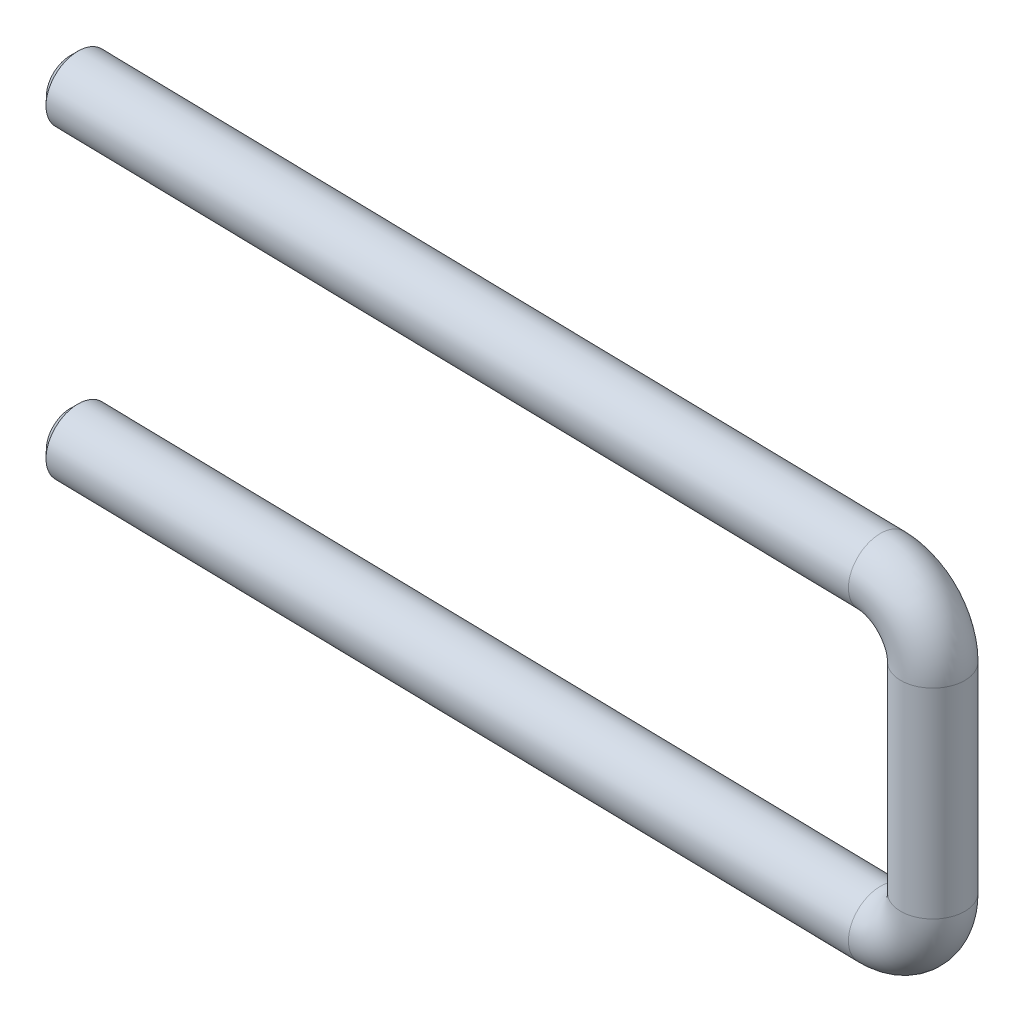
ISO-10303-21;
HEADER;
FILE_DESCRIPTION(('STEP AP214'),'2;1');
FILE_NAME('part.step','',(''),(''),'','','');
FILE_SCHEMA(('AUTOMOTIVE_DESIGN { 1 0 10303 214 1 1 1 1 }'));
ENDSEC;
DATA;
#1=APPLICATION_CONTEXT('core data for automotive mechanical design processes');
#2=APPLICATION_PROTOCOL_DEFINITION('international standard','automotive_design',2000,#1);
#3=PRODUCT_CONTEXT('',#1,'mechanical');
#4=PRODUCT('Part','Part','',(#3));
#5=PRODUCT_RELATED_PRODUCT_CATEGORY('part','',(#4));
#6=PRODUCT_DEFINITION_FORMATION('','',#4);
#7=PRODUCT_DEFINITION_CONTEXT('part definition',#1,'design');
#8=PRODUCT_DEFINITION('design','',#6,#7);
#9=PRODUCT_DEFINITION_SHAPE('','',#8);
#10=(LENGTH_UNIT() NAMED_UNIT(*) SI_UNIT(.MILLI.,.METRE.));
#11=(NAMED_UNIT(*) PLANE_ANGLE_UNIT() SI_UNIT($,.RADIAN.));
#12=(NAMED_UNIT(*) SI_UNIT($,.STERADIAN.) SOLID_ANGLE_UNIT());
#13=UNCERTAINTY_MEASURE_WITH_UNIT(LENGTH_MEASURE(1.E-05),#10,'distance_accuracy_value','');
#14=(GEOMETRIC_REPRESENTATION_CONTEXT(3) GLOBAL_UNCERTAINTY_ASSIGNED_CONTEXT((#13)) GLOBAL_UNIT_ASSIGNED_CONTEXT((#10,
#11,#12)) REPRESENTATION_CONTEXT('',''));
#15=CARTESIAN_POINT('',(0.,0.,0.));
#16=DIRECTION('',(0.,0.,1.));
#17=DIRECTION('',(1.,0.,0.));
#18=AXIS2_PLACEMENT_3D('',#15,#16,#17);
#19=CARTESIAN_POINT('',(-17.5405855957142,39.4239179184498,-0.785698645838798));
#20=DIRECTION('',(-0.999797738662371,0.,-0.0201117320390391));
#21=DIRECTION('',(0.,-1.,0.));
#22=AXIS2_PLACEMENT_3D('',#19,#20,#21);
#23=PLANE('',#22);
#24=CARTESIAN_POINT('',(-17.540585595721,39.4239179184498,-0.785698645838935));
#25=DIRECTION('',(0.999797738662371,0.,0.0201117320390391));
#26=DIRECTION('',(0.,1.,0.));
#27=AXIS2_PLACEMENT_3D('',#24,#25,#26);
#28=CIRCLE('',#27,1.49999999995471);
#29=CARTESIAN_POINT('',(-17.540585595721,40.9239179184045,-0.78569864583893));
#30=VERTEX_POINT('',#29);
#31=EDGE_CURVE('E15',#30,#30,#28,.T.);
#32=ORIENTED_EDGE('',*,*,#31,.F.);
#33=EDGE_LOOP('',(#32));
#34=FACE_BOUND('',#33,.T.);
#35=ADVANCED_FACE('F12',(#34),#23,.T.);
#36=CARTESIAN_POINT('',(-17.0406867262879,39.4239179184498,-0.775642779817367));
#37=DIRECTION('',(0.999797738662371,0.,0.0201117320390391));
#38=DIRECTION('',(0.,1.,0.));
#39=AXIS2_PLACEMENT_3D('',#36,#37,#38);
#40=CONICAL_SURFACE('',#39,2.00000000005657,0.785398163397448);
#41=CARTESIAN_POINT('',(-17.040686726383,39.4239179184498,-0.775642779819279));
#42=DIRECTION('',(-0.999797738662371,0.,-0.0201117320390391));
#43=DIRECTION('',(0.,-1.,0.));
#44=AXIS2_PLACEMENT_3D('',#41,#42,#43);
#45=CIRCLE('',#44,2.);
#46=CARTESIAN_POINT('',(-17.040686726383,37.4239179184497,-0.775642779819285));
#47=VERTEX_POINT('',#46);
#48=EDGE_CURVE('E59',#47,#47,#45,.F.);
#49=ORIENTED_EDGE('',*,*,#48,.F.);
#50=EDGE_LOOP('',(#49));
#51=FACE_BOUND('',#50,.T.);
#52=ORIENTED_EDGE('',*,*,#31,.T.);
#53=EDGE_LOOP('',(#52));
#54=FACE_BOUND('',#53,.T.);
#55=ADVANCED_FACE('F111',(#51,#54),#40,.T.);
#56=CARTESIAN_POINT('',(34.1489574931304,39.4239179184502,0.254077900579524));
#57=DIRECTION('',(-0.999797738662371,0.,-0.0201117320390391));
#58=DIRECTION('',(0.,-1.,0.));
#59=AXIS2_PLACEMENT_3D('',#56,#57,#58);
#60=CYLINDRICAL_SURFACE('',#59,2.);
#61=ORIENTED_EDGE('',*,*,#48,.T.);
#62=EDGE_LOOP('',(#61));
#63=FACE_BOUND('',#62,.T.);
#64=CARTESIAN_POINT('',(34.1489574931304,39.4239179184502,0.254077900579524));
#65=DIRECTION('',(-0.999797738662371,0.,-0.0201117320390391));
#66=DIRECTION('',(0.,1.,0.));
#67=AXIS2_PLACEMENT_3D('',#64,#65,#66);
#68=CIRCLE('',#67,2.);
#69=CARTESIAN_POINT('',(34.1489574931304,41.4239179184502,0.25407790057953));
#70=VERTEX_POINT('',#69);
#71=EDGE_CURVE('E56',#70,#70,#68,.F.);
#72=ORIENTED_EDGE('',*,*,#71,.F.);
#73=EDGE_LOOP('',(#72));
#74=FACE_BOUND('',#73,.T.);
#75=ADVANCED_FACE('F51',(#63,#74),#60,.T.);
#76=CARTESIAN_POINT('',(34.1489574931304,36.1239179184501,0.254077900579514));
#77=DIRECTION('',(-0.0201117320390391,0.,0.999797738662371));
#78=DIRECTION('',(0.999797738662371,0.,0.0201117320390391));
#79=AXIS2_PLACEMENT_3D('',#76,#77,#78);
#80=TOROIDAL_SURFACE('',#79,3.29999999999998,2.);
#81=ORIENTED_EDGE('',*,*,#71,.T.);
#82=EDGE_LOOP('',(#81));
#83=FACE_BOUND('',#82,.T.);
#84=CARTESIAN_POINT('',(37.4482900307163,36.1239179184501,0.320446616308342));
#85=DIRECTION('',(0.,1.,0.));
#86=DIRECTION('',(-0.999797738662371,0.,-0.0201117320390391));
#87=AXIS2_PLACEMENT_3D('',#84,#85,#86);
#88=CIRCLE('',#87,2.);
#89=CARTESIAN_POINT('',(35.4486945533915,36.1239179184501,0.280223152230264));
#90=VERTEX_POINT('',#89);
#91=EDGE_CURVE('E55',#90,#90,#88,.F.);
#92=ORIENTED_EDGE('',*,*,#91,.F.);
#93=EDGE_LOOP('',(#92));
#94=FACE_BOUND('',#93,.T.);
#95=ADVANCED_FACE('F46',(#83,#94),#80,.T.);
#96=CARTESIAN_POINT('',(37.4482900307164,23.6239179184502,0.320446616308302));
#97=DIRECTION('',(0.,1.,0.));
#98=DIRECTION('',(-0.999797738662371,0.,-0.0201117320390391));
#99=AXIS2_PLACEMENT_3D('',#96,#97,#98);
#100=CYLINDRICAL_SURFACE('',#99,2.);
#101=ORIENTED_EDGE('',*,*,#91,.T.);
#102=EDGE_LOOP('',(#101));
#103=FACE_BOUND('',#102,.T.);
#104=CARTESIAN_POINT('',(37.4482900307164,23.6239179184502,0.320446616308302));
#105=DIRECTION('',(0.,1.,0.));
#106=DIRECTION('',(0.999797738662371,0.,0.0201117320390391));
#107=AXIS2_PLACEMENT_3D('',#104,#105,#106);
#108=CIRCLE('',#107,2.);
#109=CARTESIAN_POINT('',(39.4478855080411,23.6239179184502,0.360670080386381));
#110=VERTEX_POINT('',#109);
#111=EDGE_CURVE('E29',#110,#110,#108,.F.);
#112=ORIENTED_EDGE('',*,*,#111,.F.);
#113=EDGE_LOOP('',(#112));
#114=FACE_BOUND('',#113,.T.);
#115=ADVANCED_FACE('F42',(#103,#114),#100,.T.);
#116=CARTESIAN_POINT('',(-17.5405855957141,20.3239179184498,-0.785698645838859));
#117=DIRECTION('',(0.999797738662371,0.,0.0201117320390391));
#118=DIRECTION('',(0.,1.,0.));
#119=AXIS2_PLACEMENT_3D('',#116,#117,#118);
#120=PLANE('',#119);
#121=CARTESIAN_POINT('',(-17.5405855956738,20.3239179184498,-0.78569864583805));
#122=DIRECTION('',(0.999797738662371,0.,0.0201117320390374));
#123=DIRECTION('',(0.0201117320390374,0.,-0.999797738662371));
#124=AXIS2_PLACEMENT_3D('',#121,#122,#123);
#125=CIRCLE('',#124,1.49999999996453);
#126=CARTESIAN_POINT('',(-17.510417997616,20.3239179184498,-2.28539525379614));
#127=VERTEX_POINT('',#126);
#128=EDGE_CURVE('E24',#127,#127,#125,.T.);
#129=ORIENTED_EDGE('',*,*,#128,.F.);
#130=EDGE_LOOP('',(#129));
#131=FACE_BOUND('',#130,.T.);
#132=ADVANCED_FACE('F37',(#131),#120,.F.);
#133=CARTESIAN_POINT('',(34.1489574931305,23.6239179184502,0.254077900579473));
#134=DIRECTION('',(-0.0201117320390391,0.,0.999797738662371));
#135=DIRECTION('',(0.999797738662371,0.,0.0201117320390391));
#136=AXIS2_PLACEMENT_3D('',#133,#134,#135);
#137=TOROIDAL_SURFACE('',#136,3.30000000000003,2.);
#138=ORIENTED_EDGE('',*,*,#111,.T.);
#139=EDGE_LOOP('',(#138));
#140=FACE_BOUND('',#139,.T.);
#141=CARTESIAN_POINT('',(34.1489574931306,20.3239179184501,0.254077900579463));
#142=DIRECTION('',(-0.999797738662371,0.,-0.0201117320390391));
#143=DIRECTION('',(0.,-1.,0.));
#144=AXIS2_PLACEMENT_3D('',#141,#142,#143);
#145=CIRCLE('',#144,2.);
#146=CARTESIAN_POINT('',(34.1489574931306,18.3239179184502,0.254077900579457));
#147=VERTEX_POINT('',#146);
#148=EDGE_CURVE('E19',#147,#147,#145,.T.);
#149=ORIENTED_EDGE('',*,*,#148,.F.);
#150=EDGE_LOOP('',(#149));
#151=FACE_BOUND('',#150,.T.);
#152=ADVANCED_FACE('F32',(#140,#151),#137,.T.);
#153=CARTESIAN_POINT('',(-17.0406867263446,20.3239179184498,-0.775642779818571));
#154=DIRECTION('',(0.999797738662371,0.,0.0201117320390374));
#155=DIRECTION('',(0.0201117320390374,0.,-0.999797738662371));
#156=AXIS2_PLACEMENT_3D('',#153,#154,#155);
#157=CONICAL_SURFACE('',#156,2.00000000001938,0.785398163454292);
#158=CARTESIAN_POINT('',(-17.0406867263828,20.3239179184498,-0.775642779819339));
#159=DIRECTION('',(-0.999797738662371,0.,-0.0201117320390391));
#160=DIRECTION('',(0.,-1.,0.));
#161=AXIS2_PLACEMENT_3D('',#158,#159,#160);
#162=CIRCLE('',#161,2.);
#163=CARTESIAN_POINT('',(-17.0406867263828,18.3239179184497,-0.775642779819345));
#164=VERTEX_POINT('',#163);
#165=EDGE_CURVE('E8',#164,#164,#162,.F.);
#166=ORIENTED_EDGE('',*,*,#165,.F.);
#167=EDGE_LOOP('',(#166));
#168=FACE_BOUND('',#167,.T.);
#169=ORIENTED_EDGE('',*,*,#128,.T.);
#170=EDGE_LOOP('',(#169));
#171=FACE_BOUND('',#170,.T.);
#172=ADVANCED_FACE('F36',(#168,#171),#157,.T.);
#173=CARTESIAN_POINT('',(34.1489574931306,20.3239179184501,0.254077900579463));
#174=DIRECTION('',(-0.999797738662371,0.,-0.0201117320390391));
#175=DIRECTION('',(0.,-1.,0.));
#176=AXIS2_PLACEMENT_3D('',#173,#174,#175);
#177=CYLINDRICAL_SURFACE('',#176,2.);
#178=ORIENTED_EDGE('',*,*,#165,.T.);
#179=EDGE_LOOP('',(#178));
#180=FACE_BOUND('',#179,.T.);
#181=ORIENTED_EDGE('',*,*,#148,.T.);
#182=EDGE_LOOP('',(#181));
#183=FACE_BOUND('',#182,.T.);
#184=ADVANCED_FACE('F73',(#180,#183),#177,.T.);
#185=CLOSED_SHELL('',(#35,#55,#75,#95,#115,#132,#152,#172,#184));
#186=MANIFOLD_SOLID_BREP('B1',#185);
#187=ADVANCED_BREP_SHAPE_REPRESENTATION('',(#18,#186),#14);
#188=SHAPE_DEFINITION_REPRESENTATION(#9,#187);
ENDSEC;
END-ISO-10303-21;
